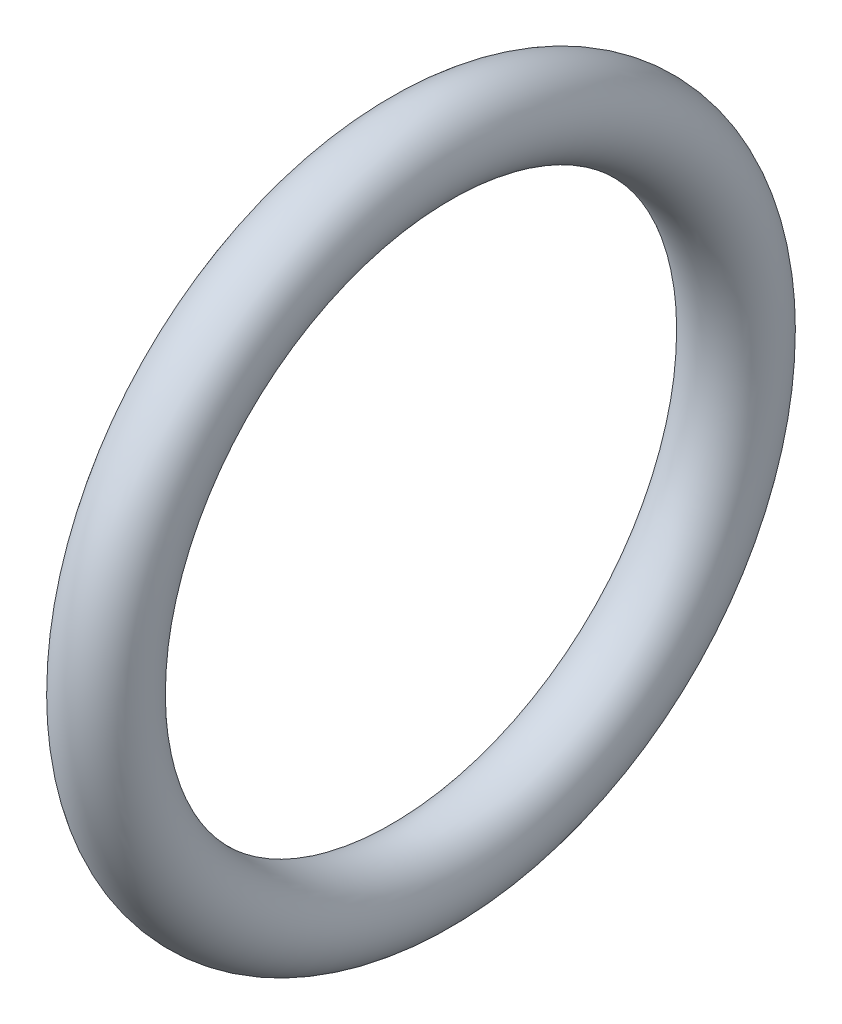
ISO-10303-21;
HEADER;
FILE_DESCRIPTION(('STEP AP214'),'2;1');
FILE_NAME('part.step','',(''),(''),'','','');
FILE_SCHEMA(('AUTOMOTIVE_DESIGN { 1 0 10303 214 1 1 1 1 }'));
ENDSEC;
DATA;
#1=APPLICATION_CONTEXT('core data for automotive mechanical design processes');
#2=APPLICATION_PROTOCOL_DEFINITION('international standard','automotive_design',2000,#1);
#3=PRODUCT_CONTEXT('',#1,'mechanical');
#4=PRODUCT('Part','Part','',(#3));
#5=PRODUCT_RELATED_PRODUCT_CATEGORY('part','',(#4));
#6=PRODUCT_DEFINITION_FORMATION('','',#4);
#7=PRODUCT_DEFINITION_CONTEXT('part definition',#1,'design');
#8=PRODUCT_DEFINITION('design','',#6,#7);
#9=PRODUCT_DEFINITION_SHAPE('','',#8);
#10=(LENGTH_UNIT() NAMED_UNIT(*) SI_UNIT(.MILLI.,.METRE.));
#11=(NAMED_UNIT(*) PLANE_ANGLE_UNIT() SI_UNIT($,.RADIAN.));
#12=(NAMED_UNIT(*) SI_UNIT($,.STERADIAN.) SOLID_ANGLE_UNIT());
#13=UNCERTAINTY_MEASURE_WITH_UNIT(LENGTH_MEASURE(1.E-05),#10,'distance_accuracy_value','');
#14=(GEOMETRIC_REPRESENTATION_CONTEXT(3) GLOBAL_UNCERTAINTY_ASSIGNED_CONTEXT((#13)) GLOBAL_UNIT_ASSIGNED_CONTEXT((#10,
#11,#12)) REPRESENTATION_CONTEXT('',''));
#15=CARTESIAN_POINT('',(0.,0.,0.));
#16=DIRECTION('',(0.,0.,1.));
#17=DIRECTION('',(1.,0.,0.));
#18=AXIS2_PLACEMENT_3D('',#15,#16,#17);
#19=CARTESIAN_POINT('',(-26.1353843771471,-1.31948873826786,0.));
#20=DIRECTION('',(-1.,0.,0.));
#21=DIRECTION('',(0.,0.,1.));
#22=AXIS2_PLACEMENT_3D('',#19,#20,#21);
#23=TOROIDAL_SURFACE('',#22,7.5,1.);
#24=CARTESIAN_POINT('',(-26.1353843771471,-1.31948873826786,8.5));
#25=VERTEX_POINT('',#24);
#26=VERTEX_LOOP('',#25);
#27=FACE_BOUND('',#26,.T.);
#28=ADVANCED_FACE('F30',(#27),#23,.T.);
#29=CLOSED_SHELL('',(#28));
#30=MANIFOLD_SOLID_BREP('B2',#29);
#31=ADVANCED_BREP_SHAPE_REPRESENTATION('',(#18,#30),#14);
#32=SHAPE_DEFINITION_REPRESENTATION(#9,#31);
ENDSEC;
END-ISO-10303-21;
